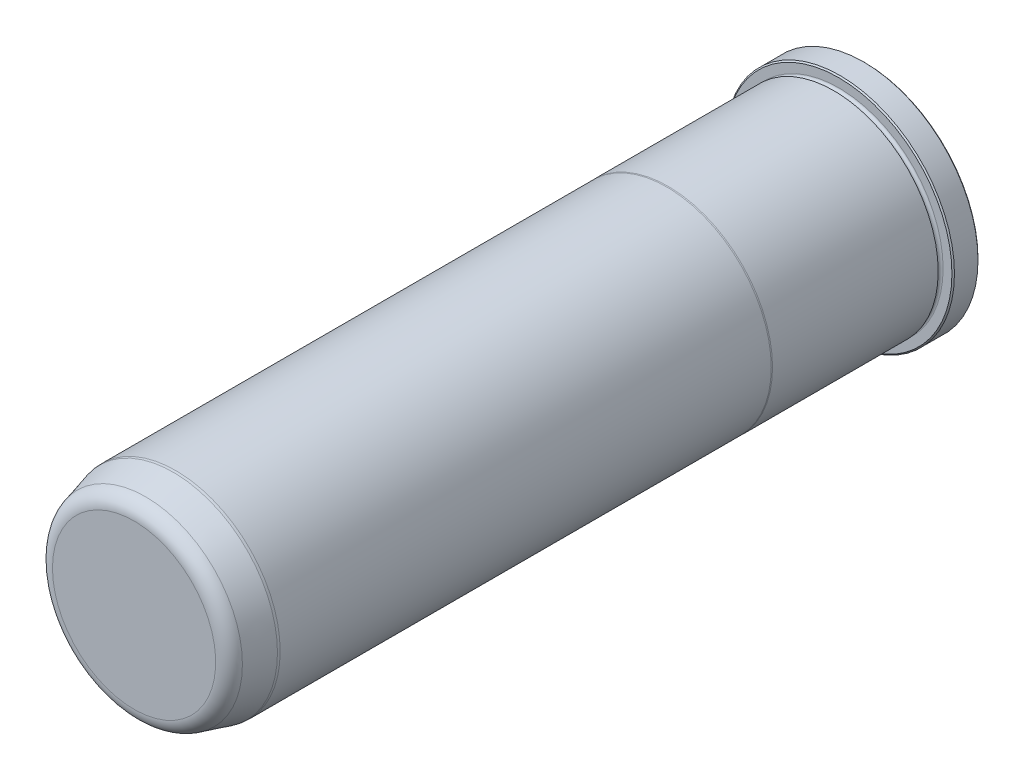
from build123d import *

# Parameters (mm, degrees)
FILLET6_R     = 4.7625
CHAMFER1_SIZE = 0.381


with BuildPart() as part:
    # Sketch1 → Revolve1 (revolve)
    with BuildSketch(Plane(origin=(0, 0, 0), x_dir=(0, 0, -1), z_dir=(1, 0, 0)), mode=Mode.PRIVATE) as revolve1_sk:
        with BuildLine():
            Line((0, 0), (0, 34.798))
            Line((0, 34.798), (-7.9248, 34.798))
            Line((-7.9248, 34.798), (-7.9248, 31.7373))
            ThreePointArc((-7.9248, 31.7373), (-8.6868, 30.9753), (-9.4488, 31.7373))
            Line((-9.4488, 31.7373), (-9.4488, 31.7627))
            Line((-9.4488, 31.7627), (-59.834763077, 31.7627))
            Line((-59.834763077, 31.7627), (-60.198, 31.7373))
            Line((-60.198, 31.7373), (-209.55, 31.7373))
            Line((-209.55, 31.7373), (-210.312, 31.670633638))
            Line((-210.312, 31.670633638), (-222.25, 28.471856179))
            Line((-222.25, 28.471856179), (-222.25, 0))
            Line((-222.25, 0), (0, 0))
        make_face()
    revolve(revolve1_sk.sketch.rotate(Axis((0, 0, 0), (0, 0, -1)), 90), axis=Axis((0, 0, 0), (0, 0, -1)))

    # Fillet6
    fillet6_edges = [part.edges().sort_by_distance(p)[0] for p in [
        (-28.471856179, 0, 222.25),
    ]]
    fillet(fillet6_edges, radius=FILLET6_R)

    # Chamfer1
    chamfer1_edges = [part.edges().sort_by_distance(p)[0] for p in [
        (-34.798, 0, 7.9248),
        (-34.798, 0, 0),
    ]]
    chamfer(chamfer1_edges, length=CHAMFER1_SIZE)


solid = part.part
